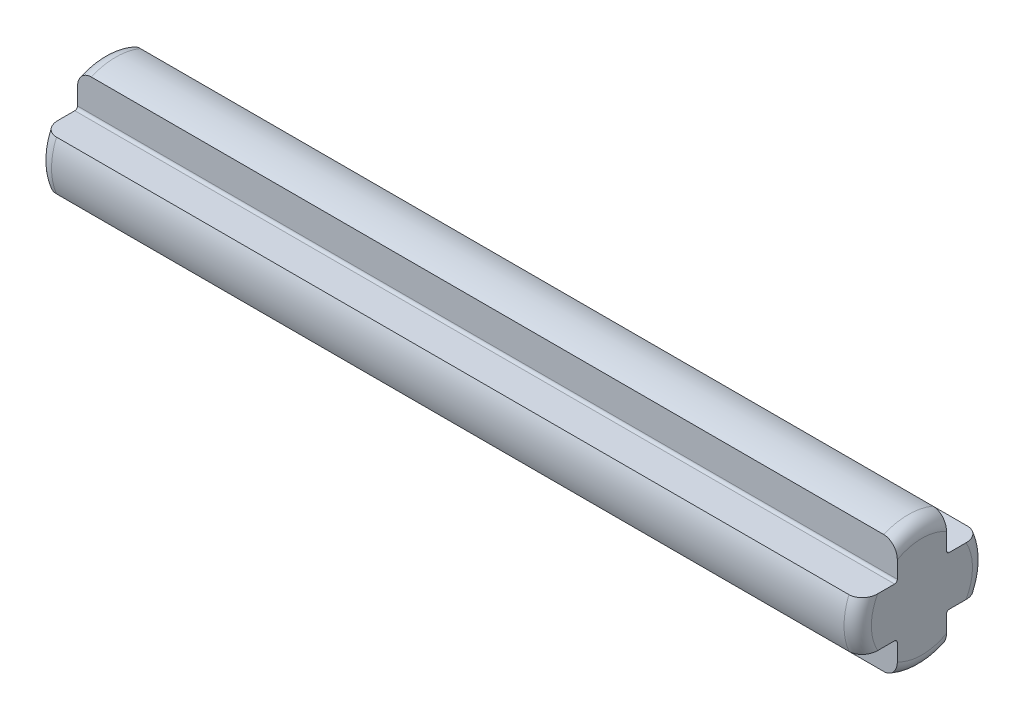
ISO-10303-21;
HEADER;
FILE_DESCRIPTION(('STEP AP214'),'2;1');
FILE_NAME('part.step','',(''),(''),'','','');
FILE_SCHEMA(('AUTOMOTIVE_DESIGN { 1 0 10303 214 1 1 1 1 }'));
ENDSEC;
DATA;
#1=APPLICATION_CONTEXT('core data for automotive mechanical design processes');
#2=APPLICATION_PROTOCOL_DEFINITION('international standard','automotive_design',2000,#1);
#3=PRODUCT_CONTEXT('',#1,'mechanical');
#4=PRODUCT('Part','Part','',(#3));
#5=PRODUCT_RELATED_PRODUCT_CATEGORY('part','',(#4));
#6=PRODUCT_DEFINITION_FORMATION('','',#4);
#7=PRODUCT_DEFINITION_CONTEXT('part definition',#1,'design');
#8=PRODUCT_DEFINITION('design','',#6,#7);
#9=PRODUCT_DEFINITION_SHAPE('','',#8);
#10=(LENGTH_UNIT() NAMED_UNIT(*) SI_UNIT(.MILLI.,.METRE.));
#11=(NAMED_UNIT(*) PLANE_ANGLE_UNIT() SI_UNIT($,.RADIAN.));
#12=(NAMED_UNIT(*) SI_UNIT($,.STERADIAN.) SOLID_ANGLE_UNIT());
#13=UNCERTAINTY_MEASURE_WITH_UNIT(LENGTH_MEASURE(1.E-05),#10,'distance_accuracy_value','');
#14=(GEOMETRIC_REPRESENTATION_CONTEXT(3) GLOBAL_UNCERTAINTY_ASSIGNED_CONTEXT((#13)) GLOBAL_UNIT_ASSIGNED_CONTEXT((#10,
#11,#12)) REPRESENTATION_CONTEXT('',''));
#15=CARTESIAN_POINT('',(0.,0.,0.));
#16=DIRECTION('',(0.,0.,1.));
#17=DIRECTION('',(1.,0.,0.));
#18=AXIS2_PLACEMENT_3D('',#15,#16,#17);
#19=CARTESIAN_POINT('',(15.,0.,0.));
#20=DIRECTION('',(-1.,0.,0.));
#21=DIRECTION('',(0.,0.,1.));
#22=AXIS2_PLACEMENT_3D('',#19,#20,#21);
#23=CYLINDRICAL_SURFACE('',#22,2.35);
#24=DIRECTION('',(-1.,0.,0.));
#25=VECTOR('',#24,1.);
#26=CARTESIAN_POINT('',(15.,0.9,2.17082933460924));
#27=LINE('',#26,#25);
#28=CARTESIAN_POINT('',(14.5,0.9,2.17082933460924));
#29=VERTEX_POINT('',#28);
#30=CARTESIAN_POINT('',(-14.5,0.9,2.17082933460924));
#31=VERTEX_POINT('',#30);
#32=EDGE_CURVE('E250',#29,#31,#27,.T.);
#33=ORIENTED_EDGE('',*,*,#32,.T.);
#34=CARTESIAN_POINT('',(-14.5,0.,0.));
#35=DIRECTION('',(1.,0.,0.));
#36=DIRECTION('',(0.,0.,-1.));
#37=AXIS2_PLACEMENT_3D('',#34,#35,#36);
#38=CIRCLE('',#37,2.35);
#39=CARTESIAN_POINT('',(-14.5,-0.900000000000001,2.17082933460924));
#40=VERTEX_POINT('',#39);
#41=EDGE_CURVE('E515',#31,#40,#38,.T.);
#42=ORIENTED_EDGE('',*,*,#41,.T.);
#43=DIRECTION('',(-1.,0.,0.));
#44=VECTOR('',#43,1.);
#45=CARTESIAN_POINT('',(15.,-0.900000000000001,2.17082933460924));
#46=LINE('',#45,#44);
#47=CARTESIAN_POINT('',(14.5,-0.900000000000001,2.17082933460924));
#48=VERTEX_POINT('',#47);
#49=EDGE_CURVE('E221',#48,#40,#46,.T.);
#50=ORIENTED_EDGE('',*,*,#49,.F.);
#51=CARTESIAN_POINT('',(14.5,0.,0.));
#52=DIRECTION('',(1.,0.,0.));
#53=DIRECTION('',(0.,0.,-1.));
#54=AXIS2_PLACEMENT_3D('',#51,#52,#53);
#55=CIRCLE('',#54,2.35);
#56=EDGE_CURVE('E370',#48,#29,#55,.F.);
#57=ORIENTED_EDGE('',*,*,#56,.T.);
#58=EDGE_LOOP('',(#33,#42,#50,#57));
#59=FACE_BOUND('',#58,.T.);
#60=ADVANCED_FACE('F37',(#59),#23,.T.);
#61=CARTESIAN_POINT('',(15.,-0.900000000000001,2.17082933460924));
#62=DIRECTION('',(0.,1.,0.));
#63=DIRECTION('',(0.,0.,1.));
#64=AXIS2_PLACEMENT_3D('',#61,#62,#63);
#65=PLANE('',#64);
#66=ORIENTED_EDGE('',*,*,#49,.T.);
#67=CARTESIAN_POINT('',(-14.5,-0.900000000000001,2.17082933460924));
#68=CARTESIAN_POINT('',(-14.5264833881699,-0.900000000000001,2.17085986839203));
#69=CARTESIAN_POINT('',(-14.5529498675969,-0.900000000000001,2.16855372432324));
#70=CARTESIAN_POINT('',(-14.6050453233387,-0.900000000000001,2.15950506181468));
#71=CARTESIAN_POINT('',(-14.6306762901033,-0.900000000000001,2.15277404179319));
#72=CARTESIAN_POINT('',(-14.6804387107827,-0.900000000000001,2.1351114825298));
#73=CARTESIAN_POINT('',(-14.7045703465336,-0.900000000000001,2.12418045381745));
#74=CARTESIAN_POINT('',(-14.7507251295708,-0.900000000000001,2.09852306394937));
#75=CARTESIAN_POINT('',(-14.7727475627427,-0.900000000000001,2.0837954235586));
#76=CARTESIAN_POINT('',(-14.8147234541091,-0.900000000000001,2.05060839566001));
#77=CARTESIAN_POINT('',(-14.8346070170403,-0.900000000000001,2.03206082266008));
#78=CARTESIAN_POINT('',(-14.8712243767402,-0.900000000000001,1.99209288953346));
#79=CARTESIAN_POINT('',(-14.8879579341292,-0.900000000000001,1.97067231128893));
#80=CARTESIAN_POINT('',(-14.9190973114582,-0.900000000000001,1.92396602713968));
#81=CARTESIAN_POINT('',(-14.9332527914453,-0.900000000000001,1.89851375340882));
#82=CARTESIAN_POINT('',(-14.9575247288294,-0.900000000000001,1.84573102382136));
#83=CARTESIAN_POINT('',(-14.9676367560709,-0.900000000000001,1.81839854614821));
#84=CARTESIAN_POINT('',(-14.9838866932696,-0.900000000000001,1.76219756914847));
#85=CARTESIAN_POINT('',(-14.9899702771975,-0.900000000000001,1.73331353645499));
#86=CARTESIAN_POINT('',(-14.9980270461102,-0.900000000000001,1.67505065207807));
#87=CARTESIAN_POINT('',(-15.0000109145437,-0.900000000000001,1.64567328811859));
#88=CARTESIAN_POINT('',(-15.,-0.900000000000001,1.61632298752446));
#89=B_SPLINE_CURVE_WITH_KNOTS('',3,(#67,#68,#69,#70,#71,#72,#73,#74,#75,#76,#77,#78,#79,#80,#81,
#82,#83,#84,#85,#86,#87,#88),.UNSPECIFIED.,.F.,.F.,(4,2,2,2,2,2,2,2,2,2,4),(0.,
0.0793238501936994,0.158442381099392,0.237551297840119,0.316686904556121,0.397909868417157,
0.479139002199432,0.566147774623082,0.653251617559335,0.741507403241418,0.829532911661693),.UNSPECIFIED.);
#90=CARTESIAN_POINT('',(-15.,-0.900000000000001,1.61632298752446));
#91=VERTEX_POINT('',#90);
#92=EDGE_CURVE('E390',#40,#91,#89,.T.);
#93=ORIENTED_EDGE('',*,*,#92,.T.);
#94=DIRECTION('',(0.,0.,-1.));
#95=VECTOR('',#94,1.);
#96=CARTESIAN_POINT('',(-15.,-0.900000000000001,2.17082933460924));
#97=LINE('',#96,#95);
#98=CARTESIAN_POINT('',(-15.,-0.900000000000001,0.999999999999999));
#99=VERTEX_POINT('',#98);
#100=EDGE_CURVE('E218',#91,#99,#97,.T.);
#101=ORIENTED_EDGE('',*,*,#100,.T.);
#102=DIRECTION('',(-1.,0.,0.));
#103=VECTOR('',#102,1.);
#104=CARTESIAN_POINT('',(15.,-0.900000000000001,0.999999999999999));
#105=LINE('',#104,#103);
#106=CARTESIAN_POINT('',(15.,-0.900000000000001,0.999999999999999));
#107=VERTEX_POINT('',#106);
#108=EDGE_CURVE('E214',#107,#99,#105,.T.);
#109=ORIENTED_EDGE('',*,*,#108,.F.);
#110=DIRECTION('',(0.,0.,-1.));
#111=VECTOR('',#110,1.);
#112=CARTESIAN_POINT('',(15.,-0.900000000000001,2.17082933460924));
#113=LINE('',#112,#111);
#114=CARTESIAN_POINT('',(15.,-0.900000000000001,1.61632298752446));
#115=VERTEX_POINT('',#114);
#116=EDGE_CURVE('E201',#115,#107,#113,.T.);
#117=ORIENTED_EDGE('',*,*,#116,.F.);
#118=CARTESIAN_POINT('',(15.,-0.900000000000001,1.61632298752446));
#119=CARTESIAN_POINT('',(15.0000222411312,-0.900000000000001,1.65066661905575));
#120=CARTESIAN_POINT('',(14.9972983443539,-0.900000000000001,1.68506058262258));
#121=CARTESIAN_POINT('',(14.9862156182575,-0.900000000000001,1.75308687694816));
#122=CARTESIAN_POINT('',(14.9778303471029,-0.900000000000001,1.78671486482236));
#123=CARTESIAN_POINT('',(14.9552419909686,-0.900000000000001,1.85211366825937));
#124=CARTESIAN_POINT('',(14.9410195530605,-0.900000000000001,1.88387790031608));
#125=CARTESIAN_POINT('',(14.9069131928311,-0.900000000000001,1.94414749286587));
#126=CARTESIAN_POINT('',(14.8870416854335,-0.900000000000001,1.97265980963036));
#127=CARTESIAN_POINT('',(14.844222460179,-0.900000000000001,2.02268935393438));
#128=CARTESIAN_POINT('',(14.8217526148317,-0.900000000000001,2.04461521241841));
#129=CARTESIAN_POINT('',(14.7730890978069,-0.900000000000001,2.08389547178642));
#130=CARTESIAN_POINT('',(14.7468952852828,-0.900000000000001,2.10124969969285));
#131=CARTESIAN_POINT('',(14.6943438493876,-0.900000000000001,2.12912089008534));
#132=CARTESIAN_POINT('',(14.6682509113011,-0.900000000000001,2.14013932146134));
#133=CARTESIAN_POINT('',(14.6145341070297,-0.900000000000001,2.15730052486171));
#134=CARTESIAN_POINT('',(14.586913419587,-0.900000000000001,2.1634530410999));
#135=CARTESIAN_POINT('',(14.5492135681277,-0.900000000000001,2.16830749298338));
#136=CARTESIAN_POINT('',(14.5393866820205,-0.900000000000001,2.1692533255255));
#137=CARTESIAN_POINT('',(14.5197081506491,-0.900000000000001,2.17051341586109));
#138=CARTESIAN_POINT('',(14.5098565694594,-0.900000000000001,2.17082867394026));
#139=CARTESIAN_POINT('',(14.5,-0.900000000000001,2.17082933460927));
#140=B_SPLINE_CURVE_WITH_KNOTS('',3,(#118,#119,#120,#121,#122,#123,#124,#125,#126,#127,#128,
#129,#130,#131,#132,#133,#134,#135,#136,#137,#138,#139),.UNSPECIFIED.,.F.,.F.,(4,2,2,2,2,2,2,2,
2,2,4),(0.,0.103000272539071,0.206484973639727,0.310315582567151,0.413919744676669,
0.507586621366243,0.601257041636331,0.68579977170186,0.770172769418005,0.799774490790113,
0.829329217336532),.UNSPECIFIED.);
#141=EDGE_CURVE('E520',#115,#48,#140,.T.);
#142=ORIENTED_EDGE('',*,*,#141,.T.);
#143=EDGE_LOOP('',(#66,#93,#101,#109,#117,#142));
#144=FACE_BOUND('',#143,.T.);
#145=ADVANCED_FACE('F216',(#144),#65,.F.);
#146=CARTESIAN_POINT('',(15.,-1.,0.999999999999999));
#147=DIRECTION('',(-1.,0.,0.));
#148=DIRECTION('',(0.,0.,1.));
#149=AXIS2_PLACEMENT_3D('',#146,#147,#148);
#150=CYLINDRICAL_SURFACE('',#149,0.0999999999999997);
#151=CARTESIAN_POINT('',(-15.,-1.,0.999999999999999));
#152=DIRECTION('',(-1.,0.,0.));
#153=DIRECTION('',(0.,0.,1.));
#154=AXIS2_PLACEMENT_3D('',#151,#152,#153);
#155=CIRCLE('',#154,0.0999999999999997);
#156=CARTESIAN_POINT('',(-15.,-1.,0.899999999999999));
#157=VERTEX_POINT('',#156);
#158=EDGE_CURVE('E252',#99,#157,#155,.T.);
#159=ORIENTED_EDGE('',*,*,#158,.T.);
#160=DIRECTION('',(-1.,0.,0.));
#161=VECTOR('',#160,1.);
#162=CARTESIAN_POINT('',(15.,-1.,0.899999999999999));
#163=LINE('',#162,#161);
#164=CARTESIAN_POINT('',(15.,-1.,0.899999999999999));
#165=VERTEX_POINT('',#164);
#166=EDGE_CURVE('E222',#165,#157,#163,.T.);
#167=ORIENTED_EDGE('',*,*,#166,.F.);
#168=CARTESIAN_POINT('',(15.,-1.,0.999999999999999));
#169=DIRECTION('',(-1.,0.,0.));
#170=DIRECTION('',(0.,0.,1.));
#171=AXIS2_PLACEMENT_3D('',#168,#169,#170);
#172=CIRCLE('',#171,0.0999999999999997);
#173=EDGE_CURVE('E207',#107,#165,#172,.T.);
#174=ORIENTED_EDGE('',*,*,#173,.F.);
#175=ORIENTED_EDGE('',*,*,#108,.T.);
#176=EDGE_LOOP('',(#159,#167,#174,#175));
#177=FACE_BOUND('',#176,.T.);
#178=ADVANCED_FACE('F224',(#177),#150,.F.);
#179=CARTESIAN_POINT('',(15.,-2.17082933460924,0.899999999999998));
#180=DIRECTION('',(0.,0.,-1.));
#181=DIRECTION('',(0.,1.,0.));
#182=AXIS2_PLACEMENT_3D('',#179,#180,#181);
#183=PLANE('',#182);
#184=DIRECTION('',(0.,-1.,0.));
#185=VECTOR('',#184,1.);
#186=CARTESIAN_POINT('',(-15.,-2.17082933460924,0.899999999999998));
#187=LINE('',#186,#185);
#188=CARTESIAN_POINT('',(-15.,-1.61632298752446,0.899999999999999));
#189=VERTEX_POINT('',#188);
#190=EDGE_CURVE('E254',#157,#189,#187,.T.);
#191=ORIENTED_EDGE('',*,*,#190,.T.);
#192=CARTESIAN_POINT('',(-15.,-1.61632298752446,0.899999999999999));
#193=CARTESIAN_POINT('',(-15.0000222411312,-1.65066661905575,0.899999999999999));
#194=CARTESIAN_POINT('',(-14.9972983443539,-1.68506058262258,0.899999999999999));
#195=CARTESIAN_POINT('',(-14.9862156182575,-1.75308687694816,0.899999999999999));
#196=CARTESIAN_POINT('',(-14.9778303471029,-1.78671486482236,0.899999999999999));
#197=CARTESIAN_POINT('',(-14.9552419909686,-1.85211366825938,0.899999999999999));
#198=CARTESIAN_POINT('',(-14.9410195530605,-1.88387790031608,0.899999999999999));
#199=CARTESIAN_POINT('',(-14.9069131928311,-1.94414749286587,0.899999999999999));
#200=CARTESIAN_POINT('',(-14.8870416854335,-1.97265980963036,0.899999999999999));
#201=CARTESIAN_POINT('',(-14.844222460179,-2.02268935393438,0.899999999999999));
#202=CARTESIAN_POINT('',(-14.8217526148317,-2.04461521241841,0.899999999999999));
#203=CARTESIAN_POINT('',(-14.7730890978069,-2.08389547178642,0.899999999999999));
#204=CARTESIAN_POINT('',(-14.7468952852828,-2.10124969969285,0.899999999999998));
#205=CARTESIAN_POINT('',(-14.6943438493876,-2.12912089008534,0.899999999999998));
#206=CARTESIAN_POINT('',(-14.6682509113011,-2.14013932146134,0.899999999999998));
#207=CARTESIAN_POINT('',(-14.6145341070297,-2.15730052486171,0.899999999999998));
#208=CARTESIAN_POINT('',(-14.586913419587,-2.1634530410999,0.899999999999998));
#209=CARTESIAN_POINT('',(-14.5492135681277,-2.16830749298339,0.899999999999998));
#210=CARTESIAN_POINT('',(-14.5393866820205,-2.1692533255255,0.899999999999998));
#211=CARTESIAN_POINT('',(-14.5197081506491,-2.17051341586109,0.899999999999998));
#212=CARTESIAN_POINT('',(-14.5098565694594,-2.17082867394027,0.899999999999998));
#213=CARTESIAN_POINT('',(-14.5,-2.17082933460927,0.899999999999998));
#214=B_SPLINE_CURVE_WITH_KNOTS('',3,(#192,#193,#194,#195,#196,#197,#198,#199,#200,#201,#202,
#203,#204,#205,#206,#207,#208,#209,#210,#211,#212,#213),.UNSPECIFIED.,.F.,.F.,(4,2,2,2,2,2,2,2,
2,2,4),(0.,0.103000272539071,0.206484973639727,0.310315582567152,0.413919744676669,
0.507586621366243,0.60125704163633,0.68579977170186,0.770172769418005,0.799774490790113,
0.829329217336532),.UNSPECIFIED.);
#215=CARTESIAN_POINT('',(-14.5,-2.17082933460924,0.899999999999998));
#216=VERTEX_POINT('',#215);
#217=EDGE_CURVE('E365',#189,#216,#214,.T.);
#218=ORIENTED_EDGE('',*,*,#217,.T.);
#219=DIRECTION('',(-1.,0.,0.));
#220=VECTOR('',#219,1.);
#221=CARTESIAN_POINT('',(15.,-2.17082933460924,0.899999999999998));
#222=LINE('',#221,#220);
#223=CARTESIAN_POINT('',(14.5,-2.17082933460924,0.899999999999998));
#224=VERTEX_POINT('',#223);
#225=EDGE_CURVE('E312',#224,#216,#222,.T.);
#226=ORIENTED_EDGE('',*,*,#225,.F.);
#227=CARTESIAN_POINT('',(14.5,-2.17082933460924,0.899999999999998));
#228=CARTESIAN_POINT('',(14.5264833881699,-2.17085986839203,0.899999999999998));
#229=CARTESIAN_POINT('',(14.5529498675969,-2.16855372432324,0.899999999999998));
#230=CARTESIAN_POINT('',(14.6050453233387,-2.15950506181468,0.899999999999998));
#231=CARTESIAN_POINT('',(14.6306762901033,-2.15277404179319,0.899999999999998));
#232=CARTESIAN_POINT('',(14.6804387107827,-2.1351114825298,0.899999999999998));
#233=CARTESIAN_POINT('',(14.7045703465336,-2.12418045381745,0.899999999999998));
#234=CARTESIAN_POINT('',(14.7507251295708,-2.09852306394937,0.899999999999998));
#235=CARTESIAN_POINT('',(14.7727475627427,-2.0837954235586,0.899999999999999));
#236=CARTESIAN_POINT('',(14.8147234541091,-2.05060839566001,0.899999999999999));
#237=CARTESIAN_POINT('',(14.8346070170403,-2.03206082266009,0.899999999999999));
#238=CARTESIAN_POINT('',(14.8712243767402,-1.99209288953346,0.899999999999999));
#239=CARTESIAN_POINT('',(14.8879579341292,-1.97067231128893,0.899999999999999));
#240=CARTESIAN_POINT('',(14.9190973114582,-1.92396602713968,0.899999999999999));
#241=CARTESIAN_POINT('',(14.9332527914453,-1.89851375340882,0.899999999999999));
#242=CARTESIAN_POINT('',(14.9575247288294,-1.84573102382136,0.899999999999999));
#243=CARTESIAN_POINT('',(14.9676367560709,-1.81839854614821,0.899999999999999));
#244=CARTESIAN_POINT('',(14.9838866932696,-1.76219756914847,0.899999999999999));
#245=CARTESIAN_POINT('',(14.9899702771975,-1.733313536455,0.899999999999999));
#246=CARTESIAN_POINT('',(14.9980270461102,-1.67505065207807,0.899999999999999));
#247=CARTESIAN_POINT('',(15.0000109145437,-1.64567328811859,0.899999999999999));
#248=CARTESIAN_POINT('',(15.,-1.61632298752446,0.899999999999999));
#249=B_SPLINE_CURVE_WITH_KNOTS('',3,(#227,#228,#229,#230,#231,#232,#233,#234,#235,#236,#237,
#238,#239,#240,#241,#242,#243,#244,#245,#246,#247,#248),.UNSPECIFIED.,.F.,.F.,(4,2,2,2,2,2,2,2,
2,2,4),(0.,0.0793238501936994,0.158442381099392,0.237551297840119,0.316686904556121,
0.397909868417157,0.479139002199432,0.566147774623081,0.653251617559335,0.741507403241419,
0.829532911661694),.UNSPECIFIED.);
#250=CARTESIAN_POINT('',(15.,-1.61632298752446,0.899999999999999));
#251=VERTEX_POINT('',#250);
#252=EDGE_CURVE('E359',#224,#251,#249,.T.);
#253=ORIENTED_EDGE('',*,*,#252,.T.);
#254=DIRECTION('',(0.,-1.,0.));
#255=VECTOR('',#254,1.);
#256=CARTESIAN_POINT('',(15.,-2.17082933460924,0.899999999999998));
#257=LINE('',#256,#255);
#258=EDGE_CURVE('E227',#165,#251,#257,.T.);
#259=ORIENTED_EDGE('',*,*,#258,.F.);
#260=ORIENTED_EDGE('',*,*,#166,.T.);
#261=EDGE_LOOP('',(#191,#218,#226,#253,#259,#260));
#262=FACE_BOUND('',#261,.T.);
#263=ADVANCED_FACE('F350',(#262),#183,.F.);
#264=CARTESIAN_POINT('',(15.,0.,0.));
#265=DIRECTION('',(-1.,0.,0.));
#266=DIRECTION('',(0.,0.,1.));
#267=AXIS2_PLACEMENT_3D('',#264,#265,#266);
#268=CYLINDRICAL_SURFACE('',#267,2.35);
#269=ORIENTED_EDGE('',*,*,#225,.T.);
#270=CARTESIAN_POINT('',(-14.5,0.,0.));
#271=DIRECTION('',(1.,0.,0.));
#272=DIRECTION('',(0.,0.,-1.));
#273=AXIS2_PLACEMENT_3D('',#270,#271,#272);
#274=CIRCLE('',#273,2.35);
#275=CARTESIAN_POINT('',(-14.5,-2.17082933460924,-0.9));
#276=VERTEX_POINT('',#275);
#277=EDGE_CURVE('E319',#216,#276,#274,.T.);
#278=ORIENTED_EDGE('',*,*,#277,.T.);
#279=DIRECTION('',(-1.,0.,0.));
#280=VECTOR('',#279,1.);
#281=CARTESIAN_POINT('',(15.,-2.17082933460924,-0.9));
#282=LINE('',#281,#280);
#283=CARTESIAN_POINT('',(14.5,-2.17082933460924,-0.9));
#284=VERTEX_POINT('',#283);
#285=EDGE_CURVE('E309',#284,#276,#282,.T.);
#286=ORIENTED_EDGE('',*,*,#285,.F.);
#287=CARTESIAN_POINT('',(14.5,0.,0.));
#288=DIRECTION('',(1.,0.,0.));
#289=DIRECTION('',(0.,0.,-1.));
#290=AXIS2_PLACEMENT_3D('',#287,#288,#289);
#291=CIRCLE('',#290,2.35);
#292=EDGE_CURVE('E317',#284,#224,#291,.F.);
#293=ORIENTED_EDGE('',*,*,#292,.T.);
#294=EDGE_LOOP('',(#269,#278,#286,#293));
#295=FACE_BOUND('',#294,.T.);
#296=ADVANCED_FACE('F344',(#295),#268,.T.);
#297=CARTESIAN_POINT('',(15.,-2.17082933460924,-0.9));
#298=DIRECTION('',(0.,0.,1.));
#299=DIRECTION('',(0.,-1.,0.));
#300=AXIS2_PLACEMENT_3D('',#297,#298,#299);
#301=PLANE('',#300);
#302=ORIENTED_EDGE('',*,*,#285,.T.);
#303=CARTESIAN_POINT('',(-14.5,-2.17082933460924,-0.9));
#304=CARTESIAN_POINT('',(-14.5264833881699,-2.17085986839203,-0.9));
#305=CARTESIAN_POINT('',(-14.5529498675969,-2.16855372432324,-0.9));
#306=CARTESIAN_POINT('',(-14.6050453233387,-2.15950506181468,-0.9));
#307=CARTESIAN_POINT('',(-14.6306762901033,-2.15277404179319,-0.9));
#308=CARTESIAN_POINT('',(-14.6804387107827,-2.1351114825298,-0.9));
#309=CARTESIAN_POINT('',(-14.7045703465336,-2.12418045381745,-0.9));
#310=CARTESIAN_POINT('',(-14.7507251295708,-2.09852306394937,-0.9));
#311=CARTESIAN_POINT('',(-14.7727475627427,-2.0837954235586,-0.9));
#312=CARTESIAN_POINT('',(-14.8147234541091,-2.05060839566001,-0.9));
#313=CARTESIAN_POINT('',(-14.8346070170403,-2.03206082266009,-0.9));
#314=CARTESIAN_POINT('',(-14.8712243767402,-1.99209288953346,-0.9));
#315=CARTESIAN_POINT('',(-14.8879579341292,-1.97067231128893,-0.9));
#316=CARTESIAN_POINT('',(-14.9190973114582,-1.92396602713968,-0.9));
#317=CARTESIAN_POINT('',(-14.9332527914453,-1.89851375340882,-0.9));
#318=CARTESIAN_POINT('',(-14.9575247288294,-1.84573102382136,-0.9));
#319=CARTESIAN_POINT('',(-14.9676367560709,-1.81839854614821,-0.9));
#320=CARTESIAN_POINT('',(-14.9838866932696,-1.76219756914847,-0.9));
#321=CARTESIAN_POINT('',(-14.9899702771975,-1.733313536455,-0.9));
#322=CARTESIAN_POINT('',(-14.9980270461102,-1.67505065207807,-0.9));
#323=CARTESIAN_POINT('',(-15.0000109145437,-1.64567328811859,-0.9));
#324=CARTESIAN_POINT('',(-15.,-1.61632298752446,-0.9));
#325=B_SPLINE_CURVE_WITH_KNOTS('',3,(#303,#304,#305,#306,#307,#308,#309,#310,#311,#312,#313,
#314,#315,#316,#317,#318,#319,#320,#321,#322,#323,#324),.UNSPECIFIED.,.F.,.F.,(4,2,2,2,2,2,2,2,
2,2,4),(0.,0.0793238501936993,0.158442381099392,0.237551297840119,0.316686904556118,
0.397909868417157,0.479139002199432,0.566147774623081,0.653251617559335,0.741507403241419,
0.829532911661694),.UNSPECIFIED.);
#326=CARTESIAN_POINT('',(-15.,-1.61632298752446,-0.9));
#327=VERTEX_POINT('',#326);
#328=EDGE_CURVE('E329',#276,#327,#325,.T.);
#329=ORIENTED_EDGE('',*,*,#328,.T.);
#330=DIRECTION('',(0.,1.,0.));
#331=VECTOR('',#330,1.);
#332=CARTESIAN_POINT('',(-15.,-2.17082933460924,-0.9));
#333=LINE('',#332,#331);
#334=CARTESIAN_POINT('',(-15.,-1.,-0.9));
#335=VERTEX_POINT('',#334);
#336=EDGE_CURVE('E257',#327,#335,#333,.T.);
#337=ORIENTED_EDGE('',*,*,#336,.T.);
#338=DIRECTION('',(-1.,0.,0.));
#339=VECTOR('',#338,1.);
#340=CARTESIAN_POINT('',(15.,-1.,-0.9));
#341=LINE('',#340,#339);
#342=CARTESIAN_POINT('',(15.,-1.,-0.9));
#343=VERTEX_POINT('',#342);
#344=EDGE_CURVE('E306',#343,#335,#341,.T.);
#345=ORIENTED_EDGE('',*,*,#344,.F.);
#346=DIRECTION('',(0.,1.,0.));
#347=VECTOR('',#346,1.);
#348=CARTESIAN_POINT('',(15.,-2.17082933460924,-0.9));
#349=LINE('',#348,#347);
#350=CARTESIAN_POINT('',(15.,-1.61632298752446,-0.9));
#351=VERTEX_POINT('',#350);
#352=EDGE_CURVE('E229',#351,#343,#349,.T.);
#353=ORIENTED_EDGE('',*,*,#352,.F.);
#354=CARTESIAN_POINT('',(15.,-1.61632298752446,-0.9));
#355=CARTESIAN_POINT('',(15.0000222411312,-1.65066661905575,-0.9));
#356=CARTESIAN_POINT('',(14.9972983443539,-1.68506058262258,-0.9));
#357=CARTESIAN_POINT('',(14.9862156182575,-1.75308687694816,-0.9));
#358=CARTESIAN_POINT('',(14.9778303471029,-1.78671486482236,-0.9));
#359=CARTESIAN_POINT('',(14.9552419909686,-1.85211366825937,-0.9));
#360=CARTESIAN_POINT('',(14.9410195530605,-1.88387790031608,-0.9));
#361=CARTESIAN_POINT('',(14.9069131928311,-1.94414749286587,-0.9));
#362=CARTESIAN_POINT('',(14.8870416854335,-1.97265980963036,-0.9));
#363=CARTESIAN_POINT('',(14.844222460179,-2.02268935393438,-0.9));
#364=CARTESIAN_POINT('',(14.8217526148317,-2.04461521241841,-0.9));
#365=CARTESIAN_POINT('',(14.7730890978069,-2.08389547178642,-0.9));
#366=CARTESIAN_POINT('',(14.7468952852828,-2.10124969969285,-0.9));
#367=CARTESIAN_POINT('',(14.6943438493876,-2.12912089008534,-0.9));
#368=CARTESIAN_POINT('',(14.6682509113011,-2.14013932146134,-0.9));
#369=CARTESIAN_POINT('',(14.6145341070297,-2.15730052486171,-0.9));
#370=CARTESIAN_POINT('',(14.586913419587,-2.1634530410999,-0.9));
#371=CARTESIAN_POINT('',(14.5492135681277,-2.16830749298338,-0.9));
#372=CARTESIAN_POINT('',(14.5393866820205,-2.1692533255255,-0.9));
#373=CARTESIAN_POINT('',(14.5197081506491,-2.17051341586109,-0.9));
#374=CARTESIAN_POINT('',(14.5098565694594,-2.17082867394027,-0.9));
#375=CARTESIAN_POINT('',(14.5,-2.17082933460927,-0.9));
#376=B_SPLINE_CURVE_WITH_KNOTS('',3,(#354,#355,#356,#357,#358,#359,#360,#361,#362,#363,#364,
#365,#366,#367,#368,#369,#370,#371,#372,#373,#374,#375),.UNSPECIFIED.,.F.,.F.,(4,2,2,2,2,2,2,2,
2,2,4),(0.,0.103000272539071,0.206484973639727,0.310315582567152,0.413919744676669,
0.507586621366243,0.601257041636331,0.68579977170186,0.770172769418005,0.799774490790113,
0.829329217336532),.UNSPECIFIED.);
#377=EDGE_CURVE('E322',#351,#284,#376,.T.);
#378=ORIENTED_EDGE('',*,*,#377,.T.);
#379=EDGE_LOOP('',(#302,#329,#337,#345,#353,#378));
#380=FACE_BOUND('',#379,.T.);
#381=ADVANCED_FACE('F338',(#380),#301,.F.);
#382=CARTESIAN_POINT('',(15.,-1.,-1.));
#383=DIRECTION('',(-1.,0.,0.));
#384=DIRECTION('',(0.,0.,1.));
#385=AXIS2_PLACEMENT_3D('',#382,#383,#384);
#386=CYLINDRICAL_SURFACE('',#385,0.0999999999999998);
#387=CARTESIAN_POINT('',(-15.,-1.,-1.));
#388=DIRECTION('',(-1.,0.,0.));
#389=DIRECTION('',(0.,0.,-1.));
#390=AXIS2_PLACEMENT_3D('',#387,#388,#389);
#391=CIRCLE('',#390,0.0999999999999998);
#392=CARTESIAN_POINT('',(-15.,-0.9,-1.));
#393=VERTEX_POINT('',#392);
#394=EDGE_CURVE('E259',#335,#393,#391,.T.);
#395=ORIENTED_EDGE('',*,*,#394,.T.);
#396=DIRECTION('',(-1.,0.,0.));
#397=VECTOR('',#396,1.);
#398=CARTESIAN_POINT('',(15.,-0.9,-1.));
#399=LINE('',#398,#397);
#400=CARTESIAN_POINT('',(15.,-0.9,-1.));
#401=VERTEX_POINT('',#400);
#402=EDGE_CURVE('E303',#401,#393,#399,.T.);
#403=ORIENTED_EDGE('',*,*,#402,.F.);
#404=CARTESIAN_POINT('',(15.,-1.,-1.));
#405=DIRECTION('',(-1.,0.,0.));
#406=DIRECTION('',(0.,0.,-1.));
#407=AXIS2_PLACEMENT_3D('',#404,#405,#406);
#408=CIRCLE('',#407,0.0999999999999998);
#409=EDGE_CURVE('E233',#343,#401,#408,.T.);
#410=ORIENTED_EDGE('',*,*,#409,.F.);
#411=ORIENTED_EDGE('',*,*,#344,.T.);
#412=EDGE_LOOP('',(#395,#403,#410,#411));
#413=FACE_BOUND('',#412,.T.);
#414=ADVANCED_FACE('F343',(#413),#386,.F.);
#415=CARTESIAN_POINT('',(15.,-0.900000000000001,-2.17082933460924));
#416=DIRECTION('',(0.,1.,0.));
#417=DIRECTION('',(0.,0.,1.));
#418=AXIS2_PLACEMENT_3D('',#415,#416,#417);
#419=PLANE('',#418);
#420=DIRECTION('',(0.,0.,-1.));
#421=VECTOR('',#420,1.);
#422=CARTESIAN_POINT('',(-15.,-0.900000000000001,-2.17082933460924));
#423=LINE('',#422,#421);
#424=CARTESIAN_POINT('',(-15.,-0.9,-1.61632298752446));
#425=VERTEX_POINT('',#424);
#426=EDGE_CURVE('E261',#393,#425,#423,.T.);
#427=ORIENTED_EDGE('',*,*,#426,.T.);
#428=CARTESIAN_POINT('',(-15.,-0.9,-1.61632298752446));
#429=CARTESIAN_POINT('',(-15.0000222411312,-0.9,-1.65066661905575));
#430=CARTESIAN_POINT('',(-14.9972983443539,-0.9,-1.68506058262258));
#431=CARTESIAN_POINT('',(-14.9862156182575,-0.9,-1.75308687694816));
#432=CARTESIAN_POINT('',(-14.9778303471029,-0.9,-1.78671486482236));
#433=CARTESIAN_POINT('',(-14.9552419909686,-0.9,-1.85211366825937));
#434=CARTESIAN_POINT('',(-14.9410195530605,-0.9,-1.88387790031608));
#435=CARTESIAN_POINT('',(-14.9069131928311,-0.9,-1.94414749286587));
#436=CARTESIAN_POINT('',(-14.8870416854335,-0.9,-1.97265980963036));
#437=CARTESIAN_POINT('',(-14.844222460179,-0.9,-2.02268935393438));
#438=CARTESIAN_POINT('',(-14.8217526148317,-0.900000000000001,-2.04461521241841));
#439=CARTESIAN_POINT('',(-14.7730890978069,-0.900000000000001,-2.08389547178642));
#440=CARTESIAN_POINT('',(-14.7468952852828,-0.900000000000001,-2.10124969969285));
#441=CARTESIAN_POINT('',(-14.6943438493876,-0.900000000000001,-2.12912089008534));
#442=CARTESIAN_POINT('',(-14.6682509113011,-0.900000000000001,-2.14013932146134));
#443=CARTESIAN_POINT('',(-14.6145341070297,-0.900000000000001,-2.15730052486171));
#444=CARTESIAN_POINT('',(-14.586913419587,-0.900000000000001,-2.1634530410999));
#445=CARTESIAN_POINT('',(-14.5492135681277,-0.900000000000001,-2.16830749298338));
#446=CARTESIAN_POINT('',(-14.5393866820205,-0.900000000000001,-2.1692533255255));
#447=CARTESIAN_POINT('',(-14.5197081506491,-0.900000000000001,-2.17051341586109));
#448=CARTESIAN_POINT('',(-14.5098565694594,-0.900000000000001,-2.17082867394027));
#449=CARTESIAN_POINT('',(-14.5,-0.900000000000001,-2.17082933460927));
#450=B_SPLINE_CURVE_WITH_KNOTS('',3,(#428,#429,#430,#431,#432,#433,#434,#435,#436,#437,#438,
#439,#440,#441,#442,#443,#444,#445,#446,#447,#448,#449),.UNSPECIFIED.,.F.,.F.,(4,2,2,2,2,2,2,2,
2,2,4),(0.,0.103000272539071,0.206484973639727,0.310315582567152,0.413919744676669,
0.507586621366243,0.601257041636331,0.685799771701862,0.770172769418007,0.799774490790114,
0.829329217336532),.UNSPECIFIED.);
#451=CARTESIAN_POINT('',(-14.5,-0.9,-2.17082933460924));
#452=VERTEX_POINT('',#451);
#453=EDGE_CURVE('E489',#425,#452,#450,.T.);
#454=ORIENTED_EDGE('',*,*,#453,.T.);
#455=DIRECTION('',(-1.,0.,0.));
#456=VECTOR('',#455,1.);
#457=CARTESIAN_POINT('',(15.,-0.9,-2.17082933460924));
#458=LINE('',#457,#456);
#459=CARTESIAN_POINT('',(14.5,-0.9,-2.17082933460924));
#460=VERTEX_POINT('',#459);
#461=EDGE_CURVE('E300',#460,#452,#458,.T.);
#462=ORIENTED_EDGE('',*,*,#461,.F.);
#463=CARTESIAN_POINT('',(14.5,-0.9,-2.17082933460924));
#464=CARTESIAN_POINT('',(14.5264833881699,-0.9,-2.17085986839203));
#465=CARTESIAN_POINT('',(14.5529498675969,-0.900000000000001,-2.16855372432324));
#466=CARTESIAN_POINT('',(14.6050453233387,-0.900000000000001,-2.15950506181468));
#467=CARTESIAN_POINT('',(14.6306762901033,-0.900000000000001,-2.15277404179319));
#468=CARTESIAN_POINT('',(14.6804387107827,-0.900000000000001,-2.1351114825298));
#469=CARTESIAN_POINT('',(14.7045703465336,-0.900000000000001,-2.12418045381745));
#470=CARTESIAN_POINT('',(14.7507251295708,-0.900000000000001,-2.09852306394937));
#471=CARTESIAN_POINT('',(14.7727475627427,-0.900000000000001,-2.0837954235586));
#472=CARTESIAN_POINT('',(14.8147234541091,-0.900000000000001,-2.05060839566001));
#473=CARTESIAN_POINT('',(14.8346070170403,-0.9,-2.03206082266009));
#474=CARTESIAN_POINT('',(14.8712243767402,-0.9,-1.99209288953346));
#475=CARTESIAN_POINT('',(14.8879579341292,-0.9,-1.97067231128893));
#476=CARTESIAN_POINT('',(14.9190973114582,-0.9,-1.92396602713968));
#477=CARTESIAN_POINT('',(14.9332527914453,-0.9,-1.89851375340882));
#478=CARTESIAN_POINT('',(14.9575247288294,-0.9,-1.84573102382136));
#479=CARTESIAN_POINT('',(14.9676367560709,-0.9,-1.81839854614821));
#480=CARTESIAN_POINT('',(14.9838866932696,-0.9,-1.76219756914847));
#481=CARTESIAN_POINT('',(14.9899702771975,-0.9,-1.733313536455));
#482=CARTESIAN_POINT('',(14.9980270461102,-0.9,-1.67505065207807));
#483=CARTESIAN_POINT('',(15.0000109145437,-0.9,-1.64567328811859));
#484=CARTESIAN_POINT('',(15.,-0.9,-1.61632298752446));
#485=B_SPLINE_CURVE_WITH_KNOTS('',3,(#463,#464,#465,#466,#467,#468,#469,#470,#471,#472,#473,
#474,#475,#476,#477,#478,#479,#480,#481,#482,#483,#484),.UNSPECIFIED.,.F.,.F.,(4,2,2,2,2,2,2,2,
2,2,4),(0.,0.0793238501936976,0.158442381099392,0.237551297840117,0.316686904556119,
0.397909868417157,0.479139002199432,0.566147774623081,0.653251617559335,0.741507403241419,
0.829532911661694),.UNSPECIFIED.);
#486=CARTESIAN_POINT('',(15.,-0.9,-1.61632298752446));
#487=VERTEX_POINT('',#486);
#488=EDGE_CURVE('E53',#460,#487,#485,.T.);
#489=ORIENTED_EDGE('',*,*,#488,.T.);
#490=DIRECTION('',(0.,0.,-1.));
#491=VECTOR('',#490,1.);
#492=CARTESIAN_POINT('',(15.,-0.900000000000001,-2.17082933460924));
#493=LINE('',#492,#491);
#494=EDGE_CURVE('E235',#401,#487,#493,.T.);
#495=ORIENTED_EDGE('',*,*,#494,.F.);
#496=ORIENTED_EDGE('',*,*,#402,.T.);
#497=EDGE_LOOP('',(#427,#454,#462,#489,#495,#496));
#498=FACE_BOUND('',#497,.T.);
#499=ADVANCED_FACE('F496',(#498),#419,.F.);
#500=CARTESIAN_POINT('',(15.,0.,0.));
#501=DIRECTION('',(-1.,0.,0.));
#502=DIRECTION('',(0.,0.,1.));
#503=AXIS2_PLACEMENT_3D('',#500,#501,#502);
#504=CYLINDRICAL_SURFACE('',#503,2.35);
#505=ORIENTED_EDGE('',*,*,#461,.T.);
#506=CARTESIAN_POINT('',(-14.5,0.,0.));
#507=DIRECTION('',(1.,0.,0.));
#508=DIRECTION('',(0.,0.,-1.));
#509=AXIS2_PLACEMENT_3D('',#506,#507,#508);
#510=CIRCLE('',#509,2.35);
#511=CARTESIAN_POINT('',(-14.5,0.900000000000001,-2.17082933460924));
#512=VERTEX_POINT('',#511);
#513=EDGE_CURVE('E575',#452,#512,#510,.T.);
#514=ORIENTED_EDGE('',*,*,#513,.T.);
#515=DIRECTION('',(-1.,0.,0.));
#516=VECTOR('',#515,1.);
#517=CARTESIAN_POINT('',(15.,0.900000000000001,-2.17082933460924));
#518=LINE('',#517,#516);
#519=CARTESIAN_POINT('',(14.5,0.900000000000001,-2.17082933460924));
#520=VERTEX_POINT('',#519);
#521=EDGE_CURVE('E297',#520,#512,#518,.T.);
#522=ORIENTED_EDGE('',*,*,#521,.F.);
#523=CARTESIAN_POINT('',(14.5,0.,0.));
#524=DIRECTION('',(1.,0.,0.));
#525=DIRECTION('',(0.,0.,-1.));
#526=AXIS2_PLACEMENT_3D('',#523,#524,#525);
#527=CIRCLE('',#526,2.35);
#528=EDGE_CURVE('E574',#520,#460,#527,.F.);
#529=ORIENTED_EDGE('',*,*,#528,.T.);
#530=EDGE_LOOP('',(#505,#514,#522,#529));
#531=FACE_BOUND('',#530,.T.);
#532=ADVANCED_FACE('F464',(#531),#504,.T.);
#533=CARTESIAN_POINT('',(15.,0.900000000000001,-2.17082933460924));
#534=DIRECTION('',(0.,-1.,0.));
#535=DIRECTION('',(0.,0.,-1.));
#536=AXIS2_PLACEMENT_3D('',#533,#534,#535);
#537=PLANE('',#536);
#538=ORIENTED_EDGE('',*,*,#521,.T.);
#539=CARTESIAN_POINT('',(-14.5,0.900000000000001,-2.17082933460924));
#540=CARTESIAN_POINT('',(-14.5264833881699,0.900000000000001,-2.17085986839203));
#541=CARTESIAN_POINT('',(-14.5529498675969,0.900000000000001,-2.16855372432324));
#542=CARTESIAN_POINT('',(-14.6050453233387,0.900000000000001,-2.15950506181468));
#543=CARTESIAN_POINT('',(-14.6306762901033,0.900000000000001,-2.15277404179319));
#544=CARTESIAN_POINT('',(-14.6804387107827,0.900000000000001,-2.1351114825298));
#545=CARTESIAN_POINT('',(-14.7045703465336,0.900000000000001,-2.12418045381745));
#546=CARTESIAN_POINT('',(-14.7507251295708,0.900000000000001,-2.09852306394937));
#547=CARTESIAN_POINT('',(-14.7727475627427,0.900000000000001,-2.0837954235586));
#548=CARTESIAN_POINT('',(-14.8147234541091,0.900000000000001,-2.05060839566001));
#549=CARTESIAN_POINT('',(-14.8346070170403,0.9,-2.03206082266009));
#550=CARTESIAN_POINT('',(-14.8712243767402,0.9,-1.99209288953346));
#551=CARTESIAN_POINT('',(-14.8879579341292,0.9,-1.97067231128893));
#552=CARTESIAN_POINT('',(-14.9190973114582,0.9,-1.92396602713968));
#553=CARTESIAN_POINT('',(-14.9332527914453,0.9,-1.89851375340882));
#554=CARTESIAN_POINT('',(-14.9575247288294,0.9,-1.84573102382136));
#555=CARTESIAN_POINT('',(-14.9676367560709,0.9,-1.81839854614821));
#556=CARTESIAN_POINT('',(-14.9838866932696,0.9,-1.76219756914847));
#557=CARTESIAN_POINT('',(-14.9899702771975,0.9,-1.733313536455));
#558=CARTESIAN_POINT('',(-14.9980270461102,0.9,-1.67505065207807));
#559=CARTESIAN_POINT('',(-15.0000109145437,0.9,-1.64567328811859));
#560=CARTESIAN_POINT('',(-15.,0.9,-1.61632298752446));
#561=B_SPLINE_CURVE_WITH_KNOTS('',3,(#539,#540,#541,#542,#543,#544,#545,#546,#547,#548,#549,
#550,#551,#552,#553,#554,#555,#556,#557,#558,#559,#560),.UNSPECIFIED.,.F.,.F.,(4,2,2,2,2,2,2,2,
2,2,4),(0.,0.0793238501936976,0.158442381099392,0.237551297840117,0.316686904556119,
0.397909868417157,0.479139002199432,0.566147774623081,0.653251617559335,0.741507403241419,
0.829532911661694),.UNSPECIFIED.);
#562=CARTESIAN_POINT('',(-15.,0.9,-1.61632298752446));
#563=VERTEX_POINT('',#562);
#564=EDGE_CURVE('E473',#512,#563,#561,.T.);
#565=ORIENTED_EDGE('',*,*,#564,.T.);
#566=DIRECTION('',(0.,0.,1.));
#567=VECTOR('',#566,1.);
#568=CARTESIAN_POINT('',(-15.,0.900000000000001,-2.17082933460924));
#569=LINE('',#568,#567);
#570=CARTESIAN_POINT('',(-15.,0.9,-1.));
#571=VERTEX_POINT('',#570);
#572=EDGE_CURVE('E264',#563,#571,#569,.T.);
#573=ORIENTED_EDGE('',*,*,#572,.T.);
#574=DIRECTION('',(-1.,0.,0.));
#575=VECTOR('',#574,1.);
#576=CARTESIAN_POINT('',(15.,0.9,-1.));
#577=LINE('',#576,#575);
#578=CARTESIAN_POINT('',(15.,0.9,-1.));
#579=VERTEX_POINT('',#578);
#580=EDGE_CURVE('E294',#579,#571,#577,.T.);
#581=ORIENTED_EDGE('',*,*,#580,.F.);
#582=DIRECTION('',(0.,0.,1.));
#583=VECTOR('',#582,1.);
#584=CARTESIAN_POINT('',(15.,0.900000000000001,-2.17082933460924));
#585=LINE('',#584,#583);
#586=CARTESIAN_POINT('',(15.,0.9,-1.61632298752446));
#587=VERTEX_POINT('',#586);
#588=EDGE_CURVE('E237',#587,#579,#585,.T.);
#589=ORIENTED_EDGE('',*,*,#588,.F.);
#590=CARTESIAN_POINT('',(15.,0.9,-1.61632298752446));
#591=CARTESIAN_POINT('',(15.0000222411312,0.9,-1.65066661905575));
#592=CARTESIAN_POINT('',(14.9972983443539,0.9,-1.68506058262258));
#593=CARTESIAN_POINT('',(14.9862156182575,0.9,-1.75308687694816));
#594=CARTESIAN_POINT('',(14.9778303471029,0.9,-1.78671486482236));
#595=CARTESIAN_POINT('',(14.9552419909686,0.9,-1.85211366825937));
#596=CARTESIAN_POINT('',(14.9410195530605,0.9,-1.88387790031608));
#597=CARTESIAN_POINT('',(14.9069131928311,0.9,-1.94414749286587));
#598=CARTESIAN_POINT('',(14.8870416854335,0.9,-1.97265980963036));
#599=CARTESIAN_POINT('',(14.844222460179,0.9,-2.02268935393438));
#600=CARTESIAN_POINT('',(14.8217526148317,0.900000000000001,-2.04461521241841));
#601=CARTESIAN_POINT('',(14.7730890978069,0.900000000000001,-2.08389547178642));
#602=CARTESIAN_POINT('',(14.7468952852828,0.900000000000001,-2.10124969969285));
#603=CARTESIAN_POINT('',(14.6943438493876,0.900000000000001,-2.12912089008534));
#604=CARTESIAN_POINT('',(14.6682509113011,0.900000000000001,-2.14013932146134));
#605=CARTESIAN_POINT('',(14.6145341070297,0.900000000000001,-2.15730052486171));
#606=CARTESIAN_POINT('',(14.586913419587,0.900000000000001,-2.1634530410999));
#607=CARTESIAN_POINT('',(14.5492135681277,0.900000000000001,-2.16830749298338));
#608=CARTESIAN_POINT('',(14.5393866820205,0.900000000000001,-2.1692533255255));
#609=CARTESIAN_POINT('',(14.5197081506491,0.900000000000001,-2.17051341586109));
#610=CARTESIAN_POINT('',(14.5098565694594,0.900000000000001,-2.17082867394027));
#611=CARTESIAN_POINT('',(14.5,0.900000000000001,-2.17082933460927));
#612=B_SPLINE_CURVE_WITH_KNOTS('',3,(#590,#591,#592,#593,#594,#595,#596,#597,#598,#599,#600,
#601,#602,#603,#604,#605,#606,#607,#608,#609,#610,#611),.UNSPECIFIED.,.F.,.F.,(4,2,2,2,2,2,2,2,
2,2,4),(0.,0.103000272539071,0.206484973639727,0.310315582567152,0.413919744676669,
0.507586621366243,0.601257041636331,0.685799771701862,0.770172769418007,0.799774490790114,
0.829329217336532),.UNSPECIFIED.);
#613=EDGE_CURVE('E61',#587,#520,#612,.T.);
#614=ORIENTED_EDGE('',*,*,#613,.T.);
#615=EDGE_LOOP('',(#538,#565,#573,#581,#589,#614));
#616=FACE_BOUND('',#615,.T.);
#617=ADVANCED_FACE('F459',(#616),#537,.F.);
#618=CARTESIAN_POINT('',(15.,1.,-1.));
#619=DIRECTION('',(-1.,0.,0.));
#620=DIRECTION('',(0.,0.,1.));
#621=AXIS2_PLACEMENT_3D('',#618,#619,#620);
#622=CYLINDRICAL_SURFACE('',#621,0.0999999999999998);
#623=CARTESIAN_POINT('',(-15.,1.,-1.));
#624=DIRECTION('',(-1.,0.,0.));
#625=DIRECTION('',(0.,0.,1.));
#626=AXIS2_PLACEMENT_3D('',#623,#624,#625);
#627=CIRCLE('',#626,0.0999999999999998);
#628=CARTESIAN_POINT('',(-15.,1.,-0.9));
#629=VERTEX_POINT('',#628);
#630=EDGE_CURVE('E266',#571,#629,#627,.T.);
#631=ORIENTED_EDGE('',*,*,#630,.T.);
#632=DIRECTION('',(-1.,0.,0.));
#633=VECTOR('',#632,1.);
#634=CARTESIAN_POINT('',(15.,1.,-0.9));
#635=LINE('',#634,#633);
#636=CARTESIAN_POINT('',(15.,1.,-0.9));
#637=VERTEX_POINT('',#636);
#638=EDGE_CURVE('E291',#637,#629,#635,.T.);
#639=ORIENTED_EDGE('',*,*,#638,.F.);
#640=CARTESIAN_POINT('',(15.,1.,-1.));
#641=DIRECTION('',(-1.,0.,0.));
#642=DIRECTION('',(0.,0.,1.));
#643=AXIS2_PLACEMENT_3D('',#640,#641,#642);
#644=CIRCLE('',#643,0.0999999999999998);
#645=EDGE_CURVE('E239',#579,#637,#644,.T.);
#646=ORIENTED_EDGE('',*,*,#645,.F.);
#647=ORIENTED_EDGE('',*,*,#580,.T.);
#648=EDGE_LOOP('',(#631,#639,#646,#647));
#649=FACE_BOUND('',#648,.T.);
#650=ADVANCED_FACE('F454',(#649),#622,.F.);
#651=CARTESIAN_POINT('',(15.,2.17082933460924,-0.9));
#652=DIRECTION('',(0.,0.,1.));
#653=DIRECTION('',(0.,-1.,0.));
#654=AXIS2_PLACEMENT_3D('',#651,#652,#653);
#655=PLANE('',#654);
#656=DIRECTION('',(0.,1.,0.));
#657=VECTOR('',#656,1.);
#658=CARTESIAN_POINT('',(-15.,2.17082933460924,-0.9));
#659=LINE('',#658,#657);
#660=CARTESIAN_POINT('',(-15.,1.61632298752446,-0.9));
#661=VERTEX_POINT('',#660);
#662=EDGE_CURVE('E268',#629,#661,#659,.T.);
#663=ORIENTED_EDGE('',*,*,#662,.T.);
#664=CARTESIAN_POINT('',(-15.,1.61632298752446,-0.9));
#665=CARTESIAN_POINT('',(-15.0000222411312,1.65066661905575,-0.9));
#666=CARTESIAN_POINT('',(-14.9972983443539,1.68506058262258,-0.9));
#667=CARTESIAN_POINT('',(-14.9862156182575,1.75308687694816,-0.9));
#668=CARTESIAN_POINT('',(-14.9778303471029,1.78671486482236,-0.9));
#669=CARTESIAN_POINT('',(-14.9552419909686,1.85211366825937,-0.9));
#670=CARTESIAN_POINT('',(-14.9410195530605,1.88387790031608,-0.9));
#671=CARTESIAN_POINT('',(-14.9069131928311,1.94414749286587,-0.9));
#672=CARTESIAN_POINT('',(-14.8870416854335,1.97265980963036,-0.9));
#673=CARTESIAN_POINT('',(-14.844222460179,2.02268935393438,-0.9));
#674=CARTESIAN_POINT('',(-14.8217526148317,2.04461521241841,-0.9));
#675=CARTESIAN_POINT('',(-14.7730890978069,2.08389547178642,-0.9));
#676=CARTESIAN_POINT('',(-14.7468952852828,2.10124969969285,-0.9));
#677=CARTESIAN_POINT('',(-14.6943438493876,2.12912089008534,-0.9));
#678=CARTESIAN_POINT('',(-14.6682509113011,2.14013932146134,-0.9));
#679=CARTESIAN_POINT('',(-14.6145341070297,2.15730052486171,-0.9));
#680=CARTESIAN_POINT('',(-14.586913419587,2.1634530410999,-0.9));
#681=CARTESIAN_POINT('',(-14.5492135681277,2.16830749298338,-0.9));
#682=CARTESIAN_POINT('',(-14.5393866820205,2.1692533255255,-0.9));
#683=CARTESIAN_POINT('',(-14.5197081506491,2.17051341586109,-0.9));
#684=CARTESIAN_POINT('',(-14.5098565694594,2.17082867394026,-0.9));
#685=CARTESIAN_POINT('',(-14.5,2.17082933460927,-0.9));
#686=B_SPLINE_CURVE_WITH_KNOTS('',3,(#664,#665,#666,#667,#668,#669,#670,#671,#672,#673,#674,
#675,#676,#677,#678,#679,#680,#681,#682,#683,#684,#685),.UNSPECIFIED.,.F.,.F.,(4,2,2,2,2,2,2,2,
2,2,4),(0.,0.103000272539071,0.206484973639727,0.310315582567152,0.413919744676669,
0.507586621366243,0.601257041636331,0.68579977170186,0.770172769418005,0.799774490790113,
0.829329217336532),.UNSPECIFIED.);
#687=CARTESIAN_POINT('',(-14.5,2.17082933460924,-0.9));
#688=VERTEX_POINT('',#687);
#689=EDGE_CURVE('E445',#661,#688,#686,.T.);
#690=ORIENTED_EDGE('',*,*,#689,.T.);
#691=DIRECTION('',(-1.,0.,0.));
#692=VECTOR('',#691,1.);
#693=CARTESIAN_POINT('',(15.,2.17082933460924,-0.9));
#694=LINE('',#693,#692);
#695=CARTESIAN_POINT('',(14.5,2.17082933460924,-0.9));
#696=VERTEX_POINT('',#695);
#697=EDGE_CURVE('E288',#696,#688,#694,.T.);
#698=ORIENTED_EDGE('',*,*,#697,.F.);
#699=CARTESIAN_POINT('',(14.5,2.17082933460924,-0.9));
#700=CARTESIAN_POINT('',(14.5264833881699,2.17085986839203,-0.9));
#701=CARTESIAN_POINT('',(14.5529498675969,2.16855372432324,-0.9));
#702=CARTESIAN_POINT('',(14.6050453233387,2.15950506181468,-0.9));
#703=CARTESIAN_POINT('',(14.6306762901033,2.15277404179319,-0.9));
#704=CARTESIAN_POINT('',(14.6804387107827,2.1351114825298,-0.9));
#705=CARTESIAN_POINT('',(14.7045703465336,2.12418045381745,-0.9));
#706=CARTESIAN_POINT('',(14.7507251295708,2.09852306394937,-0.9));
#707=CARTESIAN_POINT('',(14.7727475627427,2.0837954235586,-0.9));
#708=CARTESIAN_POINT('',(14.8147234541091,2.05060839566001,-0.9));
#709=CARTESIAN_POINT('',(14.8346070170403,2.03206082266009,-0.9));
#710=CARTESIAN_POINT('',(14.8712243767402,1.99209288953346,-0.9));
#711=CARTESIAN_POINT('',(14.8879579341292,1.97067231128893,-0.9));
#712=CARTESIAN_POINT('',(14.9190973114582,1.92396602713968,-0.9));
#713=CARTESIAN_POINT('',(14.9332527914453,1.89851375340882,-0.9));
#714=CARTESIAN_POINT('',(14.9575247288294,1.84573102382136,-0.9));
#715=CARTESIAN_POINT('',(14.9676367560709,1.81839854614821,-0.9));
#716=CARTESIAN_POINT('',(14.9838866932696,1.76219756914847,-0.9));
#717=CARTESIAN_POINT('',(14.9899702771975,1.733313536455,-0.9));
#718=CARTESIAN_POINT('',(14.9980270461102,1.67505065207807,-0.9));
#719=CARTESIAN_POINT('',(15.0000109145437,1.64567328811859,-0.9));
#720=CARTESIAN_POINT('',(15.,1.61632298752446,-0.9));
#721=B_SPLINE_CURVE_WITH_KNOTS('',3,(#699,#700,#701,#702,#703,#704,#705,#706,#707,#708,#709,
#710,#711,#712,#713,#714,#715,#716,#717,#718,#719,#720),.UNSPECIFIED.,.F.,.F.,(4,2,2,2,2,2,2,2,
2,2,4),(0.,0.0793238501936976,0.158442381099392,0.237551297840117,0.316686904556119,
0.397909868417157,0.479139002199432,0.566147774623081,0.653251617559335,0.741507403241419,
0.829532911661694),.UNSPECIFIED.);
#722=CARTESIAN_POINT('',(15.,1.61632298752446,-0.9));
#723=VERTEX_POINT('',#722);
#724=EDGE_CURVE('E440',#696,#723,#721,.T.);
#725=ORIENTED_EDGE('',*,*,#724,.T.);
#726=DIRECTION('',(0.,1.,0.));
#727=VECTOR('',#726,1.);
#728=CARTESIAN_POINT('',(15.,2.17082933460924,-0.9));
#729=LINE('',#728,#727);
#730=EDGE_CURVE('E241',#637,#723,#729,.T.);
#731=ORIENTED_EDGE('',*,*,#730,.F.);
#732=ORIENTED_EDGE('',*,*,#638,.T.);
#733=EDGE_LOOP('',(#663,#690,#698,#725,#731,#732));
#734=FACE_BOUND('',#733,.T.);
#735=ADVANCED_FACE('F450',(#734),#655,.F.);
#736=CARTESIAN_POINT('',(15.,0.,0.));
#737=DIRECTION('',(-1.,0.,0.));
#738=DIRECTION('',(0.,0.,1.));
#739=AXIS2_PLACEMENT_3D('',#736,#737,#738);
#740=CYLINDRICAL_SURFACE('',#739,2.35);
#741=ORIENTED_EDGE('',*,*,#697,.T.);
#742=CARTESIAN_POINT('',(-14.5,0.,0.));
#743=DIRECTION('',(1.,0.,0.));
#744=DIRECTION('',(0.,0.,-1.));
#745=AXIS2_PLACEMENT_3D('',#742,#743,#744);
#746=CIRCLE('',#745,2.35);
#747=CARTESIAN_POINT('',(-14.5,2.17082933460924,0.9));
#748=VERTEX_POINT('',#747);
#749=EDGE_CURVE('E572',#688,#748,#746,.T.);
#750=ORIENTED_EDGE('',*,*,#749,.T.);
#751=DIRECTION('',(-1.,0.,0.));
#752=VECTOR('',#751,1.);
#753=CARTESIAN_POINT('',(15.,2.17082933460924,0.9));
#754=LINE('',#753,#752);
#755=CARTESIAN_POINT('',(14.5,2.17082933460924,0.9));
#756=VERTEX_POINT('',#755);
#757=EDGE_CURVE('E285',#756,#748,#754,.T.);
#758=ORIENTED_EDGE('',*,*,#757,.F.);
#759=CARTESIAN_POINT('',(14.5,0.,0.));
#760=DIRECTION('',(1.,0.,0.));
#761=DIRECTION('',(0.,0.,-1.));
#762=AXIS2_PLACEMENT_3D('',#759,#760,#761);
#763=CIRCLE('',#762,2.35);
#764=EDGE_CURVE('E403',#756,#696,#763,.F.);
#765=ORIENTED_EDGE('',*,*,#764,.T.);
#766=EDGE_LOOP('',(#741,#750,#758,#765));
#767=FACE_BOUND('',#766,.T.);
#768=ADVANCED_FACE('F425',(#767),#740,.T.);
#769=CARTESIAN_POINT('',(15.,2.17082933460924,0.9));
#770=DIRECTION('',(0.,0.,-1.));
#771=DIRECTION('',(0.,1.,0.));
#772=AXIS2_PLACEMENT_3D('',#769,#770,#771);
#773=PLANE('',#772);
#774=ORIENTED_EDGE('',*,*,#757,.T.);
#775=CARTESIAN_POINT('',(-14.5,2.17082933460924,0.9));
#776=CARTESIAN_POINT('',(-14.5264833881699,2.17085986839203,0.9));
#777=CARTESIAN_POINT('',(-14.5529498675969,2.16855372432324,0.9));
#778=CARTESIAN_POINT('',(-14.6050453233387,2.15950506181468,0.9));
#779=CARTESIAN_POINT('',(-14.6306762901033,2.15277404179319,0.9));
#780=CARTESIAN_POINT('',(-14.6804387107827,2.1351114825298,0.9));
#781=CARTESIAN_POINT('',(-14.7045703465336,2.12418045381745,0.9));
#782=CARTESIAN_POINT('',(-14.7507251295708,2.09852306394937,0.9));
#783=CARTESIAN_POINT('',(-14.7727475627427,2.0837954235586,0.9));
#784=CARTESIAN_POINT('',(-14.8147234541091,2.05060839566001,0.9));
#785=CARTESIAN_POINT('',(-14.8346070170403,2.03206082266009,0.9));
#786=CARTESIAN_POINT('',(-14.8712243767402,1.99209288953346,0.9));
#787=CARTESIAN_POINT('',(-14.8879579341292,1.97067231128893,0.9));
#788=CARTESIAN_POINT('',(-14.9190973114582,1.92396602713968,0.9));
#789=CARTESIAN_POINT('',(-14.9332527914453,1.89851375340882,0.9));
#790=CARTESIAN_POINT('',(-14.9575247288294,1.84573102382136,0.9));
#791=CARTESIAN_POINT('',(-14.9676367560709,1.81839854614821,0.9));
#792=CARTESIAN_POINT('',(-14.9838866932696,1.76219756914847,0.9));
#793=CARTESIAN_POINT('',(-14.9899702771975,1.733313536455,0.9));
#794=CARTESIAN_POINT('',(-14.9980270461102,1.67505065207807,0.9));
#795=CARTESIAN_POINT('',(-15.0000109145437,1.64567328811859,0.9));
#796=CARTESIAN_POINT('',(-15.,1.61632298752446,0.9));
#797=B_SPLINE_CURVE_WITH_KNOTS('',3,(#775,#776,#777,#778,#779,#780,#781,#782,#783,#784,#785,
#786,#787,#788,#789,#790,#791,#792,#793,#794,#795,#796),.UNSPECIFIED.,.F.,.F.,(4,2,2,2,2,2,2,2,
2,2,4),(0.,0.0793238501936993,0.158442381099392,0.237551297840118,0.316686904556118,
0.397909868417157,0.479139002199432,0.566147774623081,0.653251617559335,0.741507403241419,
0.829532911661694),.UNSPECIFIED.);
#798=CARTESIAN_POINT('',(-15.,1.61632298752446,0.9));
#799=VERTEX_POINT('',#798);
#800=EDGE_CURVE('E435',#748,#799,#797,.T.);
#801=ORIENTED_EDGE('',*,*,#800,.T.);
#802=DIRECTION('',(0.,-1.,0.));
#803=VECTOR('',#802,1.);
#804=CARTESIAN_POINT('',(-15.,2.17082933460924,0.9));
#805=LINE('',#804,#803);
#806=CARTESIAN_POINT('',(-15.,1.,0.9));
#807=VERTEX_POINT('',#806);
#808=EDGE_CURVE('E271',#799,#807,#805,.T.);
#809=ORIENTED_EDGE('',*,*,#808,.T.);
#810=DIRECTION('',(-1.,0.,0.));
#811=VECTOR('',#810,1.);
#812=CARTESIAN_POINT('',(15.,1.,0.9));
#813=LINE('',#812,#811);
#814=CARTESIAN_POINT('',(15.,1.,0.9));
#815=VERTEX_POINT('',#814);
#816=EDGE_CURVE('E282',#815,#807,#813,.T.);
#817=ORIENTED_EDGE('',*,*,#816,.F.);
#818=DIRECTION('',(0.,-1.,0.));
#819=VECTOR('',#818,1.);
#820=CARTESIAN_POINT('',(15.,2.17082933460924,0.9));
#821=LINE('',#820,#819);
#822=CARTESIAN_POINT('',(15.,1.61632298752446,0.9));
#823=VERTEX_POINT('',#822);
#824=EDGE_CURVE('E244',#823,#815,#821,.T.);
#825=ORIENTED_EDGE('',*,*,#824,.F.);
#826=CARTESIAN_POINT('',(15.,1.61632298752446,0.9));
#827=CARTESIAN_POINT('',(15.0000222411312,1.65066661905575,0.9));
#828=CARTESIAN_POINT('',(14.9972983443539,1.68506058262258,0.9));
#829=CARTESIAN_POINT('',(14.9862156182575,1.75308687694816,0.9));
#830=CARTESIAN_POINT('',(14.9778303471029,1.78671486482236,0.9));
#831=CARTESIAN_POINT('',(14.9552419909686,1.85211366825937,0.9));
#832=CARTESIAN_POINT('',(14.9410195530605,1.88387790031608,0.9));
#833=CARTESIAN_POINT('',(14.9069131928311,1.94414749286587,0.9));
#834=CARTESIAN_POINT('',(14.8870416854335,1.97265980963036,0.9));
#835=CARTESIAN_POINT('',(14.844222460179,2.02268935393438,0.9));
#836=CARTESIAN_POINT('',(14.8217526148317,2.04461521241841,0.9));
#837=CARTESIAN_POINT('',(14.7730890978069,2.08389547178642,0.9));
#838=CARTESIAN_POINT('',(14.7468952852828,2.10124969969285,0.9));
#839=CARTESIAN_POINT('',(14.6943438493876,2.12912089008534,0.9));
#840=CARTESIAN_POINT('',(14.6682509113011,2.14013932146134,0.9));
#841=CARTESIAN_POINT('',(14.6145341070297,2.15730052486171,0.9));
#842=CARTESIAN_POINT('',(14.586913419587,2.1634530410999,0.9));
#843=CARTESIAN_POINT('',(14.5492135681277,2.16830749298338,0.9));
#844=CARTESIAN_POINT('',(14.5393866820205,2.1692533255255,0.9));
#845=CARTESIAN_POINT('',(14.5197081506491,2.17051341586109,0.9));
#846=CARTESIAN_POINT('',(14.5098565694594,2.17082867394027,0.9));
#847=CARTESIAN_POINT('',(14.5,2.17082933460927,0.9));
#848=B_SPLINE_CURVE_WITH_KNOTS('',3,(#826,#827,#828,#829,#830,#831,#832,#833,#834,#835,#836,
#837,#838,#839,#840,#841,#842,#843,#844,#845,#846,#847),.UNSPECIFIED.,.F.,.F.,(4,2,2,2,2,2,2,2,
2,2,4),(0.,0.103000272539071,0.206484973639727,0.310315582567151,0.413919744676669,
0.507586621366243,0.601257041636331,0.685799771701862,0.770172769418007,0.799774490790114,
0.829329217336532),.UNSPECIFIED.);
#849=EDGE_CURVE('E430',#823,#756,#848,.T.);
#850=ORIENTED_EDGE('',*,*,#849,.T.);
#851=EDGE_LOOP('',(#774,#801,#809,#817,#825,#850));
#852=FACE_BOUND('',#851,.T.);
#853=ADVANCED_FACE('F420',(#852),#773,.F.);
#854=CARTESIAN_POINT('',(15.,1.,1.));
#855=DIRECTION('',(-1.,0.,0.));
#856=DIRECTION('',(0.,0.,1.));
#857=AXIS2_PLACEMENT_3D('',#854,#855,#856);
#858=CYLINDRICAL_SURFACE('',#857,0.0999999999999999);
#859=CARTESIAN_POINT('',(-15.,1.,1.));
#860=DIRECTION('',(-1.,0.,0.));
#861=DIRECTION('',(0.,0.,-1.));
#862=AXIS2_PLACEMENT_3D('',#859,#860,#861);
#863=CIRCLE('',#862,0.0999999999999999);
#864=CARTESIAN_POINT('',(-15.,0.9,1.));
#865=VERTEX_POINT('',#864);
#866=EDGE_CURVE('E273',#807,#865,#863,.T.);
#867=ORIENTED_EDGE('',*,*,#866,.T.);
#868=DIRECTION('',(-1.,0.,0.));
#869=VECTOR('',#868,1.);
#870=CARTESIAN_POINT('',(15.,0.9,1.));
#871=LINE('',#870,#869);
#872=CARTESIAN_POINT('',(15.,0.9,1.));
#873=VERTEX_POINT('',#872);
#874=EDGE_CURVE('E279',#873,#865,#871,.T.);
#875=ORIENTED_EDGE('',*,*,#874,.F.);
#876=CARTESIAN_POINT('',(15.,1.,1.));
#877=DIRECTION('',(-1.,0.,0.));
#878=DIRECTION('',(0.,0.,-1.));
#879=AXIS2_PLACEMENT_3D('',#876,#877,#878);
#880=CIRCLE('',#879,0.0999999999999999);
#881=EDGE_CURVE('E246',#815,#873,#880,.T.);
#882=ORIENTED_EDGE('',*,*,#881,.F.);
#883=ORIENTED_EDGE('',*,*,#816,.T.);
#884=EDGE_LOOP('',(#867,#875,#882,#883));
#885=FACE_BOUND('',#884,.T.);
#886=ADVANCED_FACE('F414',(#885),#858,.F.);
#887=CARTESIAN_POINT('',(15.,0.9,2.17082933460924));
#888=DIRECTION('',(0.,-1.,0.));
#889=DIRECTION('',(0.,0.,-1.));
#890=AXIS2_PLACEMENT_3D('',#887,#888,#889);
#891=PLANE('',#890);
#892=DIRECTION('',(0.,0.,1.));
#893=VECTOR('',#892,1.);
#894=CARTESIAN_POINT('',(-15.,0.9,2.17082933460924));
#895=LINE('',#894,#893);
#896=CARTESIAN_POINT('',(-15.,0.9,1.61632298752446));
#897=VERTEX_POINT('',#896);
#898=EDGE_CURVE('E211',#865,#897,#895,.T.);
#899=ORIENTED_EDGE('',*,*,#898,.T.);
#900=CARTESIAN_POINT('',(-15.,0.9,1.61632298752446));
#901=CARTESIAN_POINT('',(-15.0000222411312,0.9,1.65066661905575));
#902=CARTESIAN_POINT('',(-14.9972983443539,0.9,1.68506058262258));
#903=CARTESIAN_POINT('',(-14.9862156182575,0.9,1.75308687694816));
#904=CARTESIAN_POINT('',(-14.9778303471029,0.9,1.78671486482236));
#905=CARTESIAN_POINT('',(-14.9552419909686,0.9,1.85211366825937));
#906=CARTESIAN_POINT('',(-14.9410195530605,0.9,1.88387790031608));
#907=CARTESIAN_POINT('',(-14.9069131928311,0.9,1.94414749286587));
#908=CARTESIAN_POINT('',(-14.8870416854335,0.9,1.97265980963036));
#909=CARTESIAN_POINT('',(-14.844222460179,0.9,2.02268935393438));
#910=CARTESIAN_POINT('',(-14.8217526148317,0.9,2.04461521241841));
#911=CARTESIAN_POINT('',(-14.7730890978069,0.9,2.08389547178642));
#912=CARTESIAN_POINT('',(-14.7468952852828,0.9,2.10124969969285));
#913=CARTESIAN_POINT('',(-14.6943438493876,0.9,2.12912089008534));
#914=CARTESIAN_POINT('',(-14.6682509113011,0.9,2.14013932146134));
#915=CARTESIAN_POINT('',(-14.6145341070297,0.9,2.15730052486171));
#916=CARTESIAN_POINT('',(-14.586913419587,0.9,2.1634530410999));
#917=CARTESIAN_POINT('',(-14.5492135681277,0.9,2.16830749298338));
#918=CARTESIAN_POINT('',(-14.5393866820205,0.9,2.1692533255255));
#919=CARTESIAN_POINT('',(-14.5197081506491,0.9,2.17051341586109));
#920=CARTESIAN_POINT('',(-14.5098565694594,0.9,2.17082867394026));
#921=CARTESIAN_POINT('',(-14.5,0.9,2.17082933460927));
#922=B_SPLINE_CURVE_WITH_KNOTS('',3,(#900,#901,#902,#903,#904,#905,#906,#907,#908,#909,#910,
#911,#912,#913,#914,#915,#916,#917,#918,#919,#920,#921),.UNSPECIFIED.,.F.,.F.,(4,2,2,2,2,2,2,2,
2,2,4),(0.,0.103000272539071,0.206484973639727,0.310315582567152,0.413919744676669,
0.507586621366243,0.601257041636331,0.685799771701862,0.770172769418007,0.799774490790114,
0.829329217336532),.UNSPECIFIED.);
#923=EDGE_CURVE('E397',#897,#31,#922,.T.);
#924=ORIENTED_EDGE('',*,*,#923,.T.);
#925=ORIENTED_EDGE('',*,*,#32,.F.);
#926=CARTESIAN_POINT('',(14.5,0.9,2.17082933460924));
#927=CARTESIAN_POINT('',(14.5264833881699,0.9,2.17085986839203));
#928=CARTESIAN_POINT('',(14.5529498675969,0.9,2.16855372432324));
#929=CARTESIAN_POINT('',(14.6050453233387,0.9,2.15950506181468));
#930=CARTESIAN_POINT('',(14.6306762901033,0.9,2.15277404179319));
#931=CARTESIAN_POINT('',(14.6804387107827,0.9,2.1351114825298));
#932=CARTESIAN_POINT('',(14.7045703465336,0.9,2.12418045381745));
#933=CARTESIAN_POINT('',(14.7507251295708,0.9,2.09852306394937));
#934=CARTESIAN_POINT('',(14.7727475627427,0.9,2.0837954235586));
#935=CARTESIAN_POINT('',(14.8147234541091,0.9,2.05060839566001));
#936=CARTESIAN_POINT('',(14.8346070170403,0.9,2.03206082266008));
#937=CARTESIAN_POINT('',(14.8712243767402,0.9,1.99209288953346));
#938=CARTESIAN_POINT('',(14.8879579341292,0.9,1.97067231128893));
#939=CARTESIAN_POINT('',(14.9190973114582,0.9,1.92396602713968));
#940=CARTESIAN_POINT('',(14.9332527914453,0.9,1.89851375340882));
#941=CARTESIAN_POINT('',(14.9575247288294,0.9,1.84573102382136));
#942=CARTESIAN_POINT('',(14.9676367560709,0.9,1.81839854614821));
#943=CARTESIAN_POINT('',(14.9838866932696,0.9,1.76219756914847));
#944=CARTESIAN_POINT('',(14.9899702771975,0.9,1.73331353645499));
#945=CARTESIAN_POINT('',(14.9980270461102,0.9,1.67505065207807));
#946=CARTESIAN_POINT('',(15.0000109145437,0.9,1.64567328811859));
#947=CARTESIAN_POINT('',(15.,0.9,1.61632298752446));
#948=B_SPLINE_CURVE_WITH_KNOTS('',3,(#926,#927,#928,#929,#930,#931,#932,#933,#934,#935,#936,
#937,#938,#939,#940,#941,#942,#943,#944,#945,#946,#947),.UNSPECIFIED.,.F.,.F.,(4,2,2,2,2,2,2,2,
2,2,4),(0.,0.0793238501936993,0.158442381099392,0.237551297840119,0.316686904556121,
0.397909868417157,0.479139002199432,0.566147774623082,0.653251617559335,0.741507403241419,
0.829532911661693),.UNSPECIFIED.);
#949=CARTESIAN_POINT('',(15.,0.9,1.61632298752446));
#950=VERTEX_POINT('',#949);
#951=EDGE_CURVE('E404',#29,#950,#948,.T.);
#952=ORIENTED_EDGE('',*,*,#951,.T.);
#953=DIRECTION('',(0.,0.,1.));
#954=VECTOR('',#953,1.);
#955=CARTESIAN_POINT('',(15.,0.9,2.17082933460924));
#956=LINE('',#955,#954);
#957=EDGE_CURVE('E248',#873,#950,#956,.T.);
#958=ORIENTED_EDGE('',*,*,#957,.F.);
#959=ORIENTED_EDGE('',*,*,#874,.T.);
#960=EDGE_LOOP('',(#899,#924,#925,#952,#958,#959));
#961=FACE_BOUND('',#960,.T.);
#962=ADVANCED_FACE('F409',(#961),#891,.F.);
#963=CARTESIAN_POINT('',(15.,0.,0.));
#964=DIRECTION('',(1.,0.,0.));
#965=DIRECTION('',(0.,0.,-1.));
#966=AXIS2_PLACEMENT_3D('',#963,#964,#965);
#967=PLANE('',#966);
#968=ORIENTED_EDGE('',*,*,#957,.T.);
#969=CARTESIAN_POINT('',(15.,0.,0.));
#970=DIRECTION('',(1.,0.,0.));
#971=DIRECTION('',(0.,0.,-1.));
#972=AXIS2_PLACEMENT_3D('',#969,#970,#971);
#973=CIRCLE('',#972,1.85);
#974=EDGE_CURVE('E11',#950,#115,#973,.T.);
#975=ORIENTED_EDGE('',*,*,#974,.T.);
#976=ORIENTED_EDGE('',*,*,#116,.T.);
#977=ORIENTED_EDGE('',*,*,#173,.T.);
#978=ORIENTED_EDGE('',*,*,#258,.T.);
#979=CARTESIAN_POINT('',(15.,0.,0.));
#980=DIRECTION('',(1.,0.,0.));
#981=DIRECTION('',(0.,0.,-1.));
#982=AXIS2_PLACEMENT_3D('',#979,#980,#981);
#983=CIRCLE('',#982,1.85);
#984=EDGE_CURVE('E46',#251,#351,#983,.T.);
#985=ORIENTED_EDGE('',*,*,#984,.T.);
#986=ORIENTED_EDGE('',*,*,#352,.T.);
#987=ORIENTED_EDGE('',*,*,#409,.T.);
#988=ORIENTED_EDGE('',*,*,#494,.T.);
#989=CARTESIAN_POINT('',(15.,0.,0.));
#990=DIRECTION('',(1.,0.,0.));
#991=DIRECTION('',(0.,0.,-1.));
#992=AXIS2_PLACEMENT_3D('',#989,#990,#991);
#993=CIRCLE('',#992,1.85);
#994=EDGE_CURVE('E581',#487,#587,#993,.T.);
#995=ORIENTED_EDGE('',*,*,#994,.T.);
#996=ORIENTED_EDGE('',*,*,#588,.T.);
#997=ORIENTED_EDGE('',*,*,#645,.T.);
#998=ORIENTED_EDGE('',*,*,#730,.T.);
#999=CARTESIAN_POINT('',(15.,0.,0.));
#1000=DIRECTION('',(1.,0.,0.));
#1001=DIRECTION('',(0.,0.,-1.));
#1002=AXIS2_PLACEMENT_3D('',#999,#1000,#1001);
#1003=CIRCLE('',#1002,1.85);
#1004=EDGE_CURVE('E494',#723,#823,#1003,.T.);
#1005=ORIENTED_EDGE('',*,*,#1004,.T.);
#1006=ORIENTED_EDGE('',*,*,#824,.T.);
#1007=ORIENTED_EDGE('',*,*,#881,.T.);
#1008=EDGE_LOOP('',(#968,#975,#976,#977,#978,#985,#986,#987,#988,#995,#996,#997,#998,#1005,
#1006,#1007));
#1009=FACE_BOUND('',#1008,.T.);
#1010=ADVANCED_FACE('F204',(#1009),#967,.T.);
#1011=CARTESIAN_POINT('',(-15.,0.,0.));
#1012=DIRECTION('',(1.,0.,0.));
#1013=DIRECTION('',(0.,0.,-1.));
#1014=AXIS2_PLACEMENT_3D('',#1011,#1012,#1013);
#1015=PLANE('',#1014);
#1016=ORIENTED_EDGE('',*,*,#336,.F.);
#1017=CARTESIAN_POINT('',(-15.,0.,0.));
#1018=DIRECTION('',(1.,0.,0.));
#1019=DIRECTION('',(0.,0.,-1.));
#1020=AXIS2_PLACEMENT_3D('',#1017,#1018,#1019);
#1021=CIRCLE('',#1020,1.85);
#1022=EDGE_CURVE('E544',#327,#189,#1021,.F.);
#1023=ORIENTED_EDGE('',*,*,#1022,.T.);
#1024=ORIENTED_EDGE('',*,*,#190,.F.);
#1025=ORIENTED_EDGE('',*,*,#158,.F.);
#1026=ORIENTED_EDGE('',*,*,#100,.F.);
#1027=CARTESIAN_POINT('',(-15.,0.,0.));
#1028=DIRECTION('',(1.,0.,0.));
#1029=DIRECTION('',(0.,0.,-1.));
#1030=AXIS2_PLACEMENT_3D('',#1027,#1028,#1029);
#1031=CIRCLE('',#1030,1.85);
#1032=EDGE_CURVE('E545',#91,#897,#1031,.F.);
#1033=ORIENTED_EDGE('',*,*,#1032,.T.);
#1034=ORIENTED_EDGE('',*,*,#898,.F.);
#1035=ORIENTED_EDGE('',*,*,#866,.F.);
#1036=ORIENTED_EDGE('',*,*,#808,.F.);
#1037=CARTESIAN_POINT('',(-15.,0.,0.));
#1038=DIRECTION('',(1.,0.,0.));
#1039=DIRECTION('',(0.,0.,-1.));
#1040=AXIS2_PLACEMENT_3D('',#1037,#1038,#1039);
#1041=CIRCLE('',#1040,1.85);
#1042=EDGE_CURVE('E550',#799,#661,#1041,.F.);
#1043=ORIENTED_EDGE('',*,*,#1042,.T.);
#1044=ORIENTED_EDGE('',*,*,#662,.F.);
#1045=ORIENTED_EDGE('',*,*,#630,.F.);
#1046=ORIENTED_EDGE('',*,*,#572,.F.);
#1047=CARTESIAN_POINT('',(-15.,0.,0.));
#1048=DIRECTION('',(1.,0.,0.));
#1049=DIRECTION('',(0.,0.,-1.));
#1050=AXIS2_PLACEMENT_3D('',#1047,#1048,#1049);
#1051=CIRCLE('',#1050,1.85);
#1052=EDGE_CURVE('E553',#563,#425,#1051,.F.);
#1053=ORIENTED_EDGE('',*,*,#1052,.T.);
#1054=ORIENTED_EDGE('',*,*,#426,.F.);
#1055=ORIENTED_EDGE('',*,*,#394,.F.);
#1056=EDGE_LOOP('',(#1016,#1023,#1024,#1025,#1026,#1033,#1034,#1035,#1036,#1043,#1044,#1045,
#1046,#1053,#1054,#1055));
#1057=FACE_BOUND('',#1056,.T.);
#1058=ADVANCED_FACE('F378',(#1057),#1015,.F.);
#1059=CARTESIAN_POINT('',(-14.5,0.,0.));
#1060=DIRECTION('',(1.,0.,0.));
#1061=DIRECTION('',(0.,0.,-1.));
#1062=AXIS2_PLACEMENT_3D('',#1059,#1060,#1061);
#1063=TOROIDAL_SURFACE('',#1062,1.85,0.5);
#1064=ORIENTED_EDGE('',*,*,#217,.F.);
#1065=ORIENTED_EDGE('',*,*,#1022,.F.);
#1066=ORIENTED_EDGE('',*,*,#328,.F.);
#1067=ORIENTED_EDGE('',*,*,#277,.F.);
#1068=EDGE_LOOP('',(#1064,#1065,#1066,#1067));
#1069=FACE_BOUND('',#1068,.T.);
#1070=ADVANCED_FACE('F372',(#1069),#1063,.T.);
#1071=CARTESIAN_POINT('',(-14.5,0.,0.));
#1072=DIRECTION('',(1.,0.,0.));
#1073=DIRECTION('',(0.,0.,-1.));
#1074=AXIS2_PLACEMENT_3D('',#1071,#1072,#1073);
#1075=TOROIDAL_SURFACE('',#1074,1.85,0.5);
#1076=ORIENTED_EDGE('',*,*,#923,.F.);
#1077=ORIENTED_EDGE('',*,*,#1032,.F.);
#1078=ORIENTED_EDGE('',*,*,#92,.F.);
#1079=ORIENTED_EDGE('',*,*,#41,.F.);
#1080=EDGE_LOOP('',(#1076,#1077,#1078,#1079));
#1081=FACE_BOUND('',#1080,.T.);
#1082=ADVANCED_FACE('F377',(#1081),#1075,.T.);
#1083=CARTESIAN_POINT('',(-14.5,0.,0.));
#1084=DIRECTION('',(1.,0.,0.));
#1085=DIRECTION('',(0.,0.,-1.));
#1086=AXIS2_PLACEMENT_3D('',#1083,#1084,#1085);
#1087=TOROIDAL_SURFACE('',#1086,1.85,0.5);
#1088=ORIENTED_EDGE('',*,*,#689,.F.);
#1089=ORIENTED_EDGE('',*,*,#1042,.F.);
#1090=ORIENTED_EDGE('',*,*,#800,.F.);
#1091=ORIENTED_EDGE('',*,*,#749,.F.);
#1092=EDGE_LOOP('',(#1088,#1089,#1090,#1091));
#1093=FACE_BOUND('',#1092,.T.);
#1094=ADVANCED_FACE('F384',(#1093),#1087,.T.);
#1095=CARTESIAN_POINT('',(-14.5,0.,0.));
#1096=DIRECTION('',(1.,0.,0.));
#1097=DIRECTION('',(0.,0.,-1.));
#1098=AXIS2_PLACEMENT_3D('',#1095,#1096,#1097);
#1099=TOROIDAL_SURFACE('',#1098,1.85,0.5);
#1100=ORIENTED_EDGE('',*,*,#453,.F.);
#1101=ORIENTED_EDGE('',*,*,#1052,.F.);
#1102=ORIENTED_EDGE('',*,*,#564,.F.);
#1103=ORIENTED_EDGE('',*,*,#513,.F.);
#1104=EDGE_LOOP('',(#1100,#1101,#1102,#1103));
#1105=FACE_BOUND('',#1104,.T.);
#1106=ADVANCED_FACE('F482',(#1105),#1099,.T.);
#1107=CARTESIAN_POINT('',(14.5,0.,0.));
#1108=DIRECTION('',(1.,0.,0.));
#1109=DIRECTION('',(0.,0.,-1.));
#1110=AXIS2_PLACEMENT_3D('',#1107,#1108,#1109);
#1111=TOROIDAL_SURFACE('',#1110,1.85,0.5);
#1112=ORIENTED_EDGE('',*,*,#951,.F.);
#1113=ORIENTED_EDGE('',*,*,#56,.F.);
#1114=ORIENTED_EDGE('',*,*,#141,.F.);
#1115=ORIENTED_EDGE('',*,*,#974,.F.);
#1116=EDGE_LOOP('',(#1112,#1113,#1114,#1115));
#1117=FACE_BOUND('',#1116,.T.);
#1118=ADVANCED_FACE('F485',(#1117),#1111,.T.);
#1119=CARTESIAN_POINT('',(14.5,0.,0.));
#1120=DIRECTION('',(1.,0.,0.));
#1121=DIRECTION('',(0.,0.,-1.));
#1122=AXIS2_PLACEMENT_3D('',#1119,#1120,#1121);
#1123=TOROIDAL_SURFACE('',#1122,1.85,0.5);
#1124=ORIENTED_EDGE('',*,*,#252,.F.);
#1125=ORIENTED_EDGE('',*,*,#292,.F.);
#1126=ORIENTED_EDGE('',*,*,#377,.F.);
#1127=ORIENTED_EDGE('',*,*,#984,.F.);
#1128=EDGE_LOOP('',(#1124,#1125,#1126,#1127));
#1129=FACE_BOUND('',#1128,.T.);
#1130=ADVANCED_FACE('F335',(#1129),#1123,.T.);
#1131=CARTESIAN_POINT('',(14.5,0.,0.));
#1132=DIRECTION('',(1.,0.,0.));
#1133=DIRECTION('',(0.,0.,-1.));
#1134=AXIS2_PLACEMENT_3D('',#1131,#1132,#1133);
#1135=TOROIDAL_SURFACE('',#1134,1.85,0.5);
#1136=ORIENTED_EDGE('',*,*,#488,.F.);
#1137=ORIENTED_EDGE('',*,*,#528,.F.);
#1138=ORIENTED_EDGE('',*,*,#613,.F.);
#1139=ORIENTED_EDGE('',*,*,#994,.F.);
#1140=EDGE_LOOP('',(#1136,#1137,#1138,#1139));
#1141=FACE_BOUND('',#1140,.T.);
#1142=ADVANCED_FACE('F534',(#1141),#1135,.T.);
#1143=CARTESIAN_POINT('',(14.5,0.,0.));
#1144=DIRECTION('',(1.,0.,0.));
#1145=DIRECTION('',(0.,0.,-1.));
#1146=AXIS2_PLACEMENT_3D('',#1143,#1144,#1145);
#1147=TOROIDAL_SURFACE('',#1146,1.85,0.5);
#1148=ORIENTED_EDGE('',*,*,#724,.F.);
#1149=ORIENTED_EDGE('',*,*,#764,.F.);
#1150=ORIENTED_EDGE('',*,*,#849,.F.);
#1151=ORIENTED_EDGE('',*,*,#1004,.F.);
#1152=EDGE_LOOP('',(#1148,#1149,#1150,#1151));
#1153=FACE_BOUND('',#1152,.T.);
#1154=ADVANCED_FACE('F39',(#1153),#1147,.T.);
#1155=CLOSED_SHELL('',(#60,#145,#178,#263,#296,#381,#414,#499,#532,#617,#650,#735,#768,#853,
#886,#962,#1010,#1058,#1070,#1082,#1094,#1106,#1118,#1130,#1142,#1154));
#1156=MANIFOLD_SOLID_BREP('B2',#1155);
#1157=ADVANCED_BREP_SHAPE_REPRESENTATION('',(#18,#1156),#14);
#1158=SHAPE_DEFINITION_REPRESENTATION(#9,#1157);
ENDSEC;
END-ISO-10303-21;
